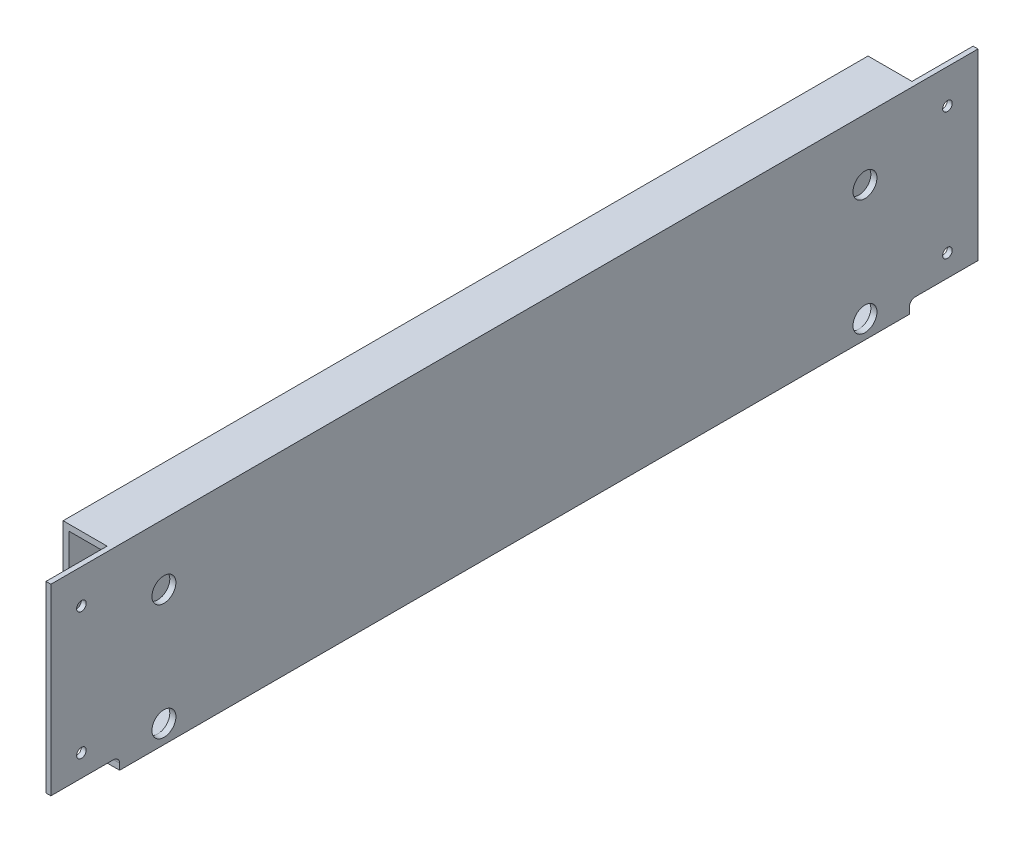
from build123d import *

# Parameters (mm, degrees)
SKETCH1_W                        = 25.4
SKETCH1_H                        = 101.6
SKETCH1_W_2                      = 19.05
SKETCH1_H_2                      = 95.25
EXTRUDE_THIN1_DEPTH              = 240.875
SKETCH2_W                        = 31.75
SKETCH2_H                        = 101.6
CUT_EXTRUDE1_DEPTH               = 22.86
SKETCH3_W                        = 35.71875
SKETCH3_H                        = 6.35
CUT_EXTRUDE2_DEPTH               = 248.480434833
F_10_CLEARANCE_HOLE1_D           = 4.9784
MIRROR2_COPY_1_D                 = 4.9784
FILLET1_R                        = 3.175
CUT_EXTRUDE3_REACH               = 249.175
SKETCH7_R                        = 6.223
F_1_4_CLEARANCE_HOLE1_AT_2_COUNT = 2
F_1_4_CLEARANCE_HOLE1_AT_2_PITCH = 60.325


with BuildPart() as part:
    # Sketch1 → Extrude-Thin1 (new, symmetric)
    with BuildSketch(Plane.XY):
        Rectangle(SKETCH1_W, SKETCH1_H)
        Rectangle(SKETCH1_W_2, SKETCH1_H_2, mode=Mode.SUBTRACT)
    extrude(amount=EXTRUDE_THIN1_DEPTH, both=True)

    # Sketch2 → Cut-Extrude1 (cut)
    with BuildSketch(Plane.ZY.offset(12.7)):
        with Locations((225, 0)):
            Rectangle(SKETCH2_W, SKETCH2_H)
    cut_extrude1 = extrude(amount=-CUT_EXTRUDE1_DEPTH, mode=Mode.SUBTRACT)

    # Sketch3 → Cut-Extrude2 (cut, through all)
    with BuildSketch(Plane.ZY.offset(12.7)):
        with Locations((223.015625, -47.625)):
            Rectangle(SKETCH3_W, SKETCH3_H)
    cut_extrude2 = extrude(amount=-CUT_EXTRUDE2_DEPTH, mode=Mode.SUBTRACT)

    # 10 Clearance Hole1 (through all)
    with Locations(Plane.ZY.offset(-10.16)):
        with Locations((225, 33.02)):
            f_10_clearance_hole1 = Hole(F_10_CLEARANCE_HOLE1_D / 2)

    # Mirror1: 10 Clearance Hole1 across plane
    add(f_10_clearance_hole1.mirror(Plane.ZX), mode=Mode.SUBTRACT)

    # Mirror2: Cut-Extrude1, Cut-Extrude2, 10 Clearance Hole1 across plane
    add(cut_extrude1.mirror(Plane.XY), mode=Mode.SUBTRACT)
    add(cut_extrude2.mirror(Plane.XY), mode=Mode.SUBTRACT)
    add(f_10_clearance_hole1.mirror(Plane.XY), mode=Mode.SUBTRACT)

    # Mirror2 copy 1 (through all)
    with Locations(Plane(origin=(10.16, 0, 0), x_dir=(0, 0, -1), z_dir=(-1, 0, 0))):
        with Locations((225, 33.02)):
            Hole(MIRROR2_COPY_1_D / 2)

    # Fillet1
    fillet1_edges = [part.edges().sort_by_distance(p)[0] for p in [
        (11.1125, -44.45, 205.15625),
        (-11.1125, -44.45, 205.15625),
        (-11.1125, -44.45, -205.15625),
        (11.1125, -44.45, -205.15625),
    ]]
    fillet(fillet1_edges, radius=FILLET1_R)

    # Sketch7 → Cut-Extrude3 (cut, up to next)
    with BuildSketch(Plane.ZY.offset(-9.525), mode=Mode.PRIVATE) as cut_extrude3_sk1:
        with Locations(Location((182.1375, -41.275, 0), (0, 0, 270))):
            Circle(SKETCH7_R)
    cut_extrude3_tool1 = extrude(cut_extrude3_sk1.sketch, amount=-CUT_EXTRUDE3_REACH, mode=Mode.PRIVATE) & part.part
    # Sketch7 → Cut-Extrude3 (cut, up to next)
    with BuildSketch(Plane.ZY.offset(-9.525), mode=Mode.PRIVATE) as cut_extrude3_sk2:
        with Locations(Location((182.1375, 19.05, 0), (0, 0, 270))):
            Circle(SKETCH7_R)
    cut_extrude3_tool2 = extrude(cut_extrude3_sk2.sketch, amount=-CUT_EXTRUDE3_REACH, mode=Mode.PRIVATE) & part.part
    cut_extrude3_1 = cut_extrude3_tool1.solids().sort_by_distance((9.525, -41.275, 182.1375))[0]
    add(cut_extrude3_1, mode=Mode.SUBTRACT)
    cut_extrude3_2 = cut_extrude3_tool2.solids().sort_by_distance((9.525, 19.05, 182.1375))[0]
    add(cut_extrude3_2, mode=Mode.SUBTRACT)
    cut_extrude3 = cut_extrude3_1 + cut_extrude3_2  # Cut-Extrude3 as one shape, for the pattern or mirror that repeats it

    # Sketch8 → 1_4 Clearance Hole1 (revolve, cut)
    with BuildSketch(Plane(origin=(-12.7, 19.05, 182.1375), x_dir=(0, 0, 1), z_dir=(0, 1, 0))):
        Polygon((0, 0), (0, 3.175), (3.8989, 3.175), (3.2639, 2.54), (3.2639, 0.635), (3.8989, 0), align=None)
    f_1_4_clearance_hole1 = revolve(axis=Axis((-19.05, 19.05, 182.1375), (1, 0, 0)), mode=Mode.SUBTRACT)

    # 1_4 Clearance Hole1 at 2: 1_4 Clearance Hole1 ×2
    with Locations(*[(0, -i * F_1_4_CLEARANCE_HOLE1_AT_2_PITCH, 0) for i in range(1, F_1_4_CLEARANCE_HOLE1_AT_2_COUNT)]):
        add(f_1_4_clearance_hole1, mode=Mode.SUBTRACT)

    # Mirror3: Cut-Extrude3, 1_4 Clearance Hole1 across plane
    add(cut_extrude3.mirror(Plane.XY), mode=Mode.SUBTRACT)
    add(f_1_4_clearance_hole1.mirror(Plane.XY), mode=Mode.SUBTRACT)

    # Mirror3 copy 1 sketch → Mirror3 copy 1 (revolve, cut)
    with BuildSketch(Plane(origin=(-12.7, -41.275, -182.1375), x_dir=(0, 0, -1), z_dir=(0, 1, 0))):
        Polygon((0, 0), (0, -3.175), (3.8989, -3.175), (3.2639, -2.54), (3.2639, -0.635), (3.8989, 0), align=None)
    revolve(axis=Axis((-19.05, -41.275, -182.1375), (-1, 0, 0)), mode=Mode.SUBTRACT)


solid = part.part
